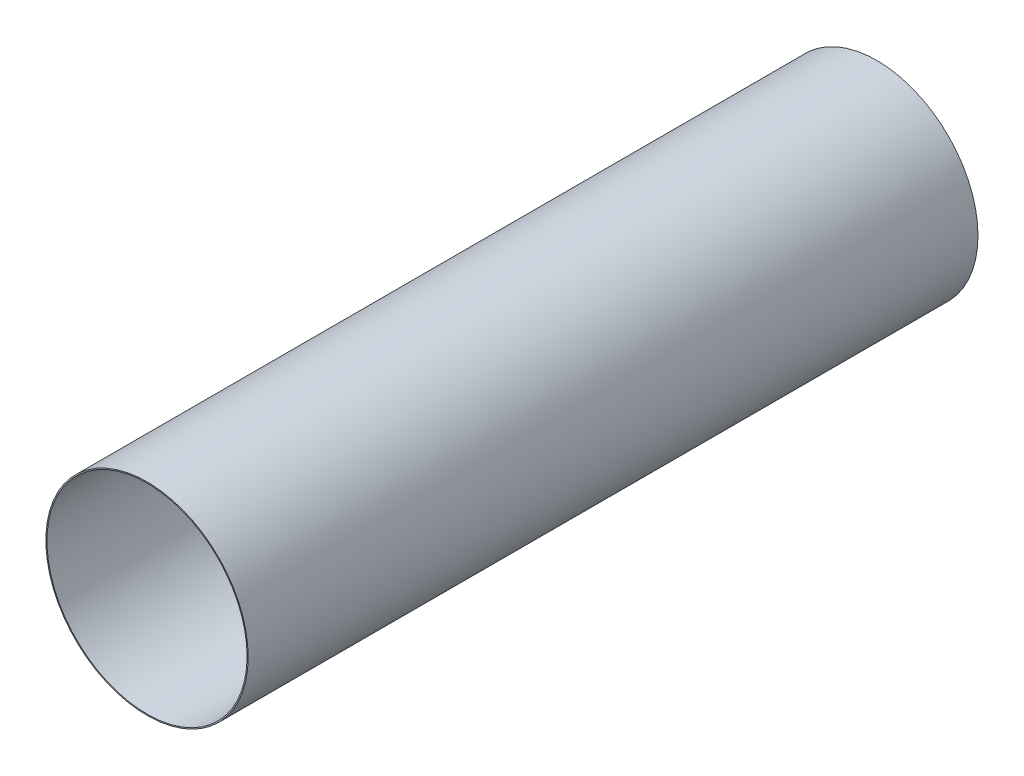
from build123d import *

# Parameters (mm, degrees)
ESQUISSE1_R        = 457.5
ESQUISSE1_R_2      = 452.5
BOSS_EXTRU_1_DEPTH = 3300


with BuildPart() as part:
    # Esquisse1 → Boss.-Extru.1 (new body)
    with BuildSketch(Plane.XY):
        Circle(ESQUISSE1_R)
        Circle(ESQUISSE1_R_2, mode=Mode.SUBTRACT)
    extrude(amount=BOSS_EXTRU_1_DEPTH)


solid = part.part
